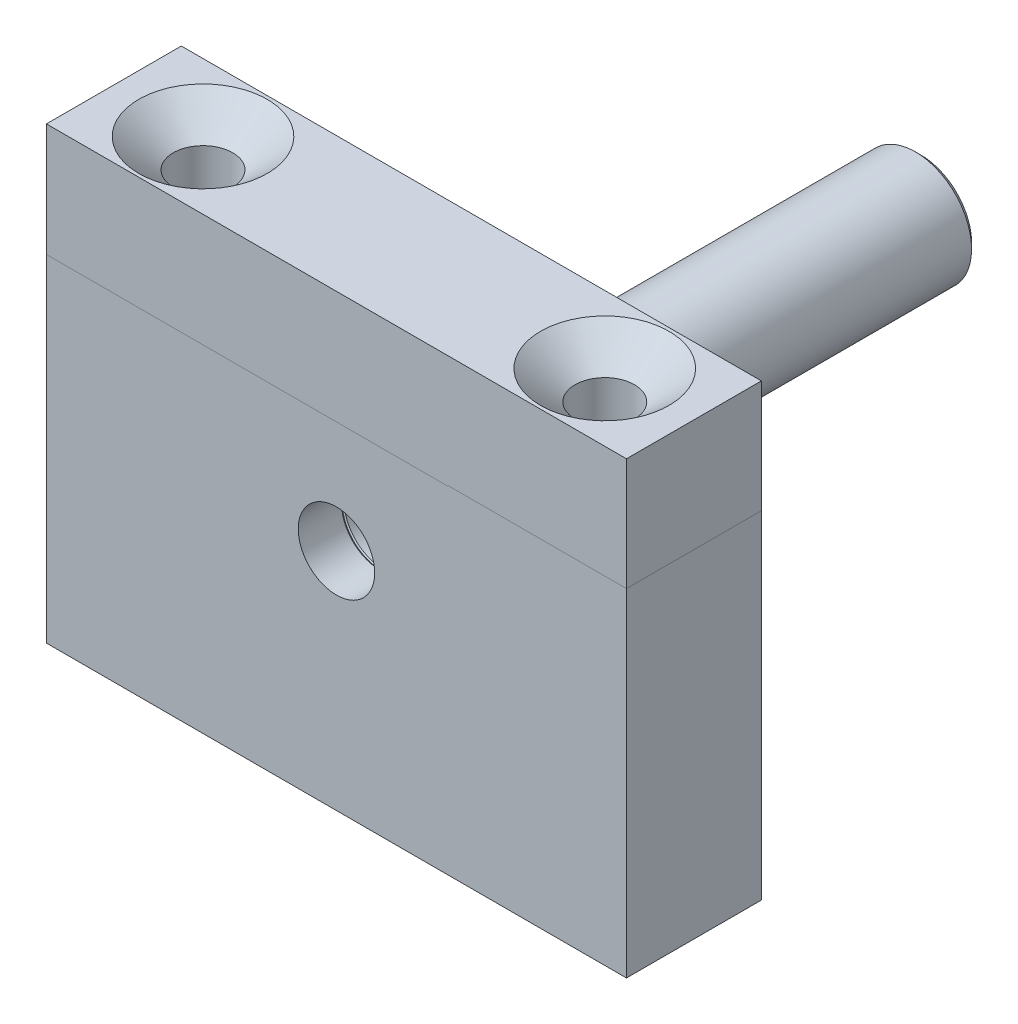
ISO-10303-21;
HEADER;
FILE_DESCRIPTION(('STEP AP214'),'2;1');
FILE_NAME('part.step','',(''),(''),'','','');
FILE_SCHEMA(('AUTOMOTIVE_DESIGN { 1 0 10303 214 1 1 1 1 }'));
ENDSEC;
DATA;
#1=APPLICATION_CONTEXT('core data for automotive mechanical design processes');
#2=APPLICATION_PROTOCOL_DEFINITION('international standard','automotive_design',2000,#1);
#3=PRODUCT_CONTEXT('',#1,'mechanical');
#4=PRODUCT('Part','Part','',(#3));
#5=PRODUCT_RELATED_PRODUCT_CATEGORY('part','',(#4));
#6=PRODUCT_DEFINITION_FORMATION('','',#4);
#7=PRODUCT_DEFINITION_CONTEXT('part definition',#1,'design');
#8=PRODUCT_DEFINITION('design','',#6,#7);
#9=PRODUCT_DEFINITION_SHAPE('','',#8);
#10=(LENGTH_UNIT() NAMED_UNIT(*) SI_UNIT(.MILLI.,.METRE.));
#11=(NAMED_UNIT(*) PLANE_ANGLE_UNIT() SI_UNIT($,.RADIAN.));
#12=(NAMED_UNIT(*) SI_UNIT($,.STERADIAN.) SOLID_ANGLE_UNIT());
#13=UNCERTAINTY_MEASURE_WITH_UNIT(LENGTH_MEASURE(1.E-05),#10,'distance_accuracy_value','');
#14=(GEOMETRIC_REPRESENTATION_CONTEXT(3) GLOBAL_UNCERTAINTY_ASSIGNED_CONTEXT((#13)) GLOBAL_UNIT_ASSIGNED_CONTEXT((#10,
#11,#12)) REPRESENTATION_CONTEXT('',''));
#15=CARTESIAN_POINT('',(0.,0.,0.));
#16=DIRECTION('',(0.,0.,1.));
#17=DIRECTION('',(1.,0.,0.));
#18=AXIS2_PLACEMENT_3D('',#15,#16,#17);
#19=CARTESIAN_POINT('',(-4.97,0.,2.01));
#20=DIRECTION('',(1.,0.,0.));
#21=DIRECTION('',(0.,1.,0.));
#22=AXIS2_PLACEMENT_3D('',#19,#20,#21);
#23=PLANE('',#22);
#24=DIRECTION('',(0.,0.,1.));
#25=VECTOR('',#24,1.);
#26=CARTESIAN_POINT('',(-4.97,4.97,-4.));
#27=LINE('',#26,#25);
#28=CARTESIAN_POINT('',(-4.97,4.97,-4.));
#29=VERTEX_POINT('',#28);
#30=CARTESIAN_POINT('',(-4.97,4.97,0.07));
#31=VERTEX_POINT('',#30);
#32=EDGE_CURVE('E91',#29,#31,#27,.T.);
#33=ORIENTED_EDGE('',*,*,#32,.F.);
#34=DIRECTION('',(0.,-1.,0.));
#35=VECTOR('',#34,1.);
#36=CARTESIAN_POINT('',(-4.97,-10.,-4.));
#37=LINE('',#36,#35);
#38=CARTESIAN_POINT('',(-4.97,0.,-4.));
#39=VERTEX_POINT('',#38);
#40=EDGE_CURVE('E243',#29,#39,#37,.T.);
#41=ORIENTED_EDGE('',*,*,#40,.T.);
#42=DIRECTION('',(0.,0.,-1.));
#43=VECTOR('',#42,1.);
#44=CARTESIAN_POINT('',(-4.97,0.,2.01));
#45=LINE('',#44,#43);
#46=CARTESIAN_POINT('',(-4.97,0.,-2.));
#47=VERTEX_POINT('',#46);
#48=EDGE_CURVE('E234',#47,#39,#45,.T.);
#49=ORIENTED_EDGE('',*,*,#48,.F.);
#50=DIRECTION('',(0.,0.,1.));
#51=VECTOR('',#50,1.);
#52=CARTESIAN_POINT('',(-4.97,0.,0.));
#53=LINE('',#52,#51);
#54=CARTESIAN_POINT('',(-4.97,0.,0.07));
#55=VERTEX_POINT('',#54);
#56=EDGE_CURVE('E244',#55,#47,#53,.F.);
#57=ORIENTED_EDGE('',*,*,#56,.F.);
#58=DIRECTION('',(0.,1.,0.));
#59=VECTOR('',#58,1.);
#60=CARTESIAN_POINT('',(-4.97,0.,0.07));
#61=LINE('',#60,#59);
#62=EDGE_CURVE('E237',#55,#31,#61,.T.);
#63=ORIENTED_EDGE('',*,*,#62,.T.);
#64=EDGE_LOOP('',(#33,#41,#49,#57,#63));
#65=FACE_BOUND('',#64,.T.);
#66=ADVANCED_FACE('F74',(#65),#23,.F.);
#67=CARTESIAN_POINT('',(4.97,0.,2.01));
#68=DIRECTION('',(-1.,0.,0.));
#69=DIRECTION('',(0.,-1.,0.));
#70=AXIS2_PLACEMENT_3D('',#67,#68,#69);
#71=PLANE('',#70);
#72=DIRECTION('',(0.,0.,-1.));
#73=VECTOR('',#72,1.);
#74=CARTESIAN_POINT('',(4.97,5.,2.));
#75=LINE('',#74,#73);
#76=CARTESIAN_POINT('',(4.97,5.,2.));
#77=VERTEX_POINT('',#76);
#78=CARTESIAN_POINT('',(4.97,5.,-4.));
#79=VERTEX_POINT('',#78);
#80=EDGE_CURVE('E204',#77,#79,#75,.T.);
#81=ORIENTED_EDGE('',*,*,#80,.F.);
#82=DIRECTION('',(0.,-1.,0.));
#83=VECTOR('',#82,1.);
#84=CARTESIAN_POINT('',(4.97,-10.,2.));
#85=LINE('',#84,#83);
#86=CARTESIAN_POINT('',(4.97,4.97,2.));
#87=VERTEX_POINT('',#86);
#88=EDGE_CURVE('E221',#77,#87,#85,.T.);
#89=ORIENTED_EDGE('',*,*,#88,.T.);
#90=DIRECTION('',(0.,0.,-1.));
#91=VECTOR('',#90,1.);
#92=CARTESIAN_POINT('',(4.97,4.97,2.01));
#93=LINE('',#92,#91);
#94=CARTESIAN_POINT('',(4.97,4.97,0.07));
#95=VERTEX_POINT('',#94);
#96=EDGE_CURVE('E188',#87,#95,#93,.T.);
#97=ORIENTED_EDGE('',*,*,#96,.T.);
#98=DIRECTION('',(0.,-1.,0.));
#99=VECTOR('',#98,1.);
#100=CARTESIAN_POINT('',(4.97,0.,0.07));
#101=LINE('',#100,#99);
#102=CARTESIAN_POINT('',(4.97,0.,0.07));
#103=VERTEX_POINT('',#102);
#104=EDGE_CURVE('E285',#95,#103,#101,.T.);
#105=ORIENTED_EDGE('',*,*,#104,.T.);
#106=DIRECTION('',(0.,0.,1.));
#107=VECTOR('',#106,1.);
#108=CARTESIAN_POINT('',(4.97,0.,0.));
#109=LINE('',#108,#107);
#110=CARTESIAN_POINT('',(4.97,0.,-2.));
#111=VERTEX_POINT('',#110);
#112=EDGE_CURVE('E276',#103,#111,#109,.F.);
#113=ORIENTED_EDGE('',*,*,#112,.T.);
#114=DIRECTION('',(0.,0.,-1.));
#115=VECTOR('',#114,1.);
#116=CARTESIAN_POINT('',(4.97,0.,2.01));
#117=LINE('',#116,#115);
#118=CARTESIAN_POINT('',(4.97,0.,-4.));
#119=VERTEX_POINT('',#118);
#120=EDGE_CURVE('E263',#111,#119,#117,.T.);
#121=ORIENTED_EDGE('',*,*,#120,.T.);
#122=DIRECTION('',(0.,1.,0.));
#123=VECTOR('',#122,1.);
#124=CARTESIAN_POINT('',(4.97,-10.,-4.));
#125=LINE('',#124,#123);
#126=EDGE_CURVE('E99',#119,#79,#125,.T.);
#127=ORIENTED_EDGE('',*,*,#126,.T.);
#128=EDGE_LOOP('',(#81,#89,#97,#105,#113,#121,#127));
#129=FACE_BOUND('',#128,.T.);
#130=ADVANCED_FACE('F324',(#129),#71,.F.);
#131=CARTESIAN_POINT('',(-4.97,10.01,0.07));
#132=DIRECTION('',(0.,0.,-1.));
#133=DIRECTION('',(-1.,0.,0.));
#134=AXIS2_PLACEMENT_3D('',#131,#132,#133);
#135=PLANE('',#134);
#136=ORIENTED_EDGE('',*,*,#104,.F.);
#137=DIRECTION('',(-1.,0.,0.));
#138=VECTOR('',#137,1.);
#139=CARTESIAN_POINT('',(4.97,4.97,0.0699999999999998));
#140=LINE('',#139,#138);
#141=CARTESIAN_POINT('',(0.,4.97,0.07));
#142=VERTEX_POINT('',#141);
#143=EDGE_CURVE('E83',#95,#142,#140,.T.);
#144=ORIENTED_EDGE('',*,*,#143,.T.);
#145=CARTESIAN_POINT('',(0.,0.,0.07));
#146=DIRECTION('',(0.,0.,-1.));
#147=DIRECTION('',(-1.,0.,0.));
#148=AXIS2_PLACEMENT_3D('',#145,#146,#147);
#149=CIRCLE('',#148,4.97);
#150=EDGE_CURVE('E13',#142,#103,#149,.T.);
#151=ORIENTED_EDGE('',*,*,#150,.T.);
#152=EDGE_LOOP('',(#136,#144,#151));
#153=FACE_BOUND('',#152,.T.);
#154=ADVANCED_FACE('F76',(#153),#135,.F.);
#155=CARTESIAN_POINT('',(0.,4.9,-2.));
#156=DIRECTION('',(0.,0.,1.));
#157=DIRECTION('',(1.,0.,0.));
#158=AXIS2_PLACEMENT_3D('',#155,#156,#157);
#159=PLANE('',#158);
#160=DIRECTION('',(-1.,0.,0.));
#161=VECTOR('',#160,1.);
#162=CARTESIAN_POINT('',(0.,0.,-2.));
#163=LINE('',#162,#161);
#164=CARTESIAN_POINT('',(3.39899494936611,0.,-2.));
#165=VERTEX_POINT('',#164);
#166=EDGE_CURVE('E270',#111,#165,#163,.T.);
#167=ORIENTED_EDGE('',*,*,#166,.F.);
#168=CARTESIAN_POINT('',(0.,0.,-2.));
#169=DIRECTION('',(0.,0.,1.));
#170=DIRECTION('',(1.,0.,0.));
#171=AXIS2_PLACEMENT_3D('',#168,#169,#170);
#172=CIRCLE('',#171,4.97);
#173=EDGE_CURVE('E275',#47,#111,#172,.F.);
#174=ORIENTED_EDGE('',*,*,#173,.F.);
#175=DIRECTION('',(-1.,0.,0.));
#176=VECTOR('',#175,1.);
#177=CARTESIAN_POINT('',(0.,0.,-2.));
#178=LINE('',#177,#176);
#179=CARTESIAN_POINT('',(-3.39899494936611,0.,-2.));
#180=VERTEX_POINT('',#179);
#181=EDGE_CURVE('E238',#180,#47,#178,.T.);
#182=ORIENTED_EDGE('',*,*,#181,.F.);
#183=CARTESIAN_POINT('',(0.,0.,-2.));
#184=DIRECTION('',(0.,0.,1.));
#185=DIRECTION('',(1.,0.,0.));
#186=AXIS2_PLACEMENT_3D('',#183,#184,#185);
#187=CIRCLE('',#186,3.39899494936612);
#188=EDGE_CURVE('E282',#165,#180,#187,.T.);
#189=ORIENTED_EDGE('',*,*,#188,.F.);
#190=EDGE_LOOP('',(#167,#174,#182,#189));
#191=FACE_BOUND('',#190,.T.);
#192=ADVANCED_FACE('F352',(#191),#159,.T.);
#193=CARTESIAN_POINT('',(0.,0.,-2.04949747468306));
#194=DIRECTION('',(0.,0.,1.));
#195=DIRECTION('',(1.,0.,0.));
#196=AXIS2_PLACEMENT_3D('',#193,#194,#195);
#197=CONICAL_SURFACE('',#196,3.34949747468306,0.785398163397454);
#198=ORIENTED_EDGE('',*,*,#188,.T.);
#199=DIRECTION('',(-0.707106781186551,0.,0.707106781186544));
#200=VECTOR('',#199,1.);
#201=CARTESIAN_POINT('',(0.,0.,-5.39899494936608));
#202=LINE('',#201,#200);
#203=CARTESIAN_POINT('',(-2.57,0.,-2.82899494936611));
#204=VERTEX_POINT('',#203);
#205=EDGE_CURVE('E233',#180,#204,#202,.F.);
#206=ORIENTED_EDGE('',*,*,#205,.T.);
#207=CARTESIAN_POINT('',(0.,0.,-2.82899494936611));
#208=DIRECTION('',(0.,0.,1.));
#209=DIRECTION('',(1.,0.,0.));
#210=AXIS2_PLACEMENT_3D('',#207,#208,#209);
#211=CIRCLE('',#210,2.57);
#212=CARTESIAN_POINT('',(2.57,0.,-2.82899494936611));
#213=VERTEX_POINT('',#212);
#214=EDGE_CURVE('E264',#204,#213,#211,.F.);
#215=ORIENTED_EDGE('',*,*,#214,.T.);
#216=DIRECTION('',(-0.707106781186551,0.,-0.707106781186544));
#217=VECTOR('',#216,1.);
#218=CARTESIAN_POINT('',(0.,0.,-5.39899494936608));
#219=LINE('',#218,#217);
#220=EDGE_CURVE('E273',#213,#165,#219,.F.);
#221=ORIENTED_EDGE('',*,*,#220,.T.);
#222=EDGE_LOOP('',(#198,#206,#215,#221));
#223=FACE_BOUND('',#222,.T.);
#224=ADVANCED_FACE('F349',(#223),#197,.F.);
#225=CARTESIAN_POINT('',(-9.9,-10.,-4.));
#226=DIRECTION('',(0.,0.,-1.));
#227=DIRECTION('',(-1.,0.,0.));
#228=AXIS2_PLACEMENT_3D('',#225,#226,#227);
#229=PLANE('',#228);
#230=DIRECTION('',(1.,0.,0.));
#231=VECTOR('',#230,1.);
#232=CARTESIAN_POINT('',(-9.9,0.,-4.));
#233=LINE('',#232,#231);
#234=CARTESIAN_POINT('',(2.57,0.,-4.));
#235=VERTEX_POINT('',#234);
#236=EDGE_CURVE('E279',#235,#119,#233,.T.);
#237=ORIENTED_EDGE('',*,*,#236,.F.);
#238=CARTESIAN_POINT('',(0.,0.,-4.));
#239=DIRECTION('',(0.,0.,-1.));
#240=DIRECTION('',(-1.,0.,0.));
#241=AXIS2_PLACEMENT_3D('',#238,#239,#240);
#242=CIRCLE('',#241,2.57);
#243=CARTESIAN_POINT('',(-2.57,0.,-4.));
#244=VERTEX_POINT('',#243);
#245=EDGE_CURVE('E266',#244,#235,#242,.T.);
#246=ORIENTED_EDGE('',*,*,#245,.F.);
#247=DIRECTION('',(1.,0.,0.));
#248=VECTOR('',#247,1.);
#249=CARTESIAN_POINT('',(-9.9,0.,-4.));
#250=LINE('',#249,#248);
#251=EDGE_CURVE('E241',#39,#244,#250,.T.);
#252=ORIENTED_EDGE('',*,*,#251,.F.);
#253=ORIENTED_EDGE('',*,*,#40,.F.);
#254=DIRECTION('',(1.,0.,0.));
#255=VECTOR('',#254,1.);
#256=CARTESIAN_POINT('',(-20.7294891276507,4.97,-4.));
#257=LINE('',#256,#255);
#258=CARTESIAN_POINT('',(-12.9,4.97,-4.));
#259=VERTEX_POINT('',#258);
#260=EDGE_CURVE('E211',#259,#29,#257,.T.);
#261=ORIENTED_EDGE('',*,*,#260,.F.);
#262=DIRECTION('',(0.,-1.,0.));
#263=VECTOR('',#262,1.);
#264=CARTESIAN_POINT('',(-12.9,10.,-4.));
#265=LINE('',#264,#263);
#266=CARTESIAN_POINT('',(-12.9,10.,-4.));
#267=VERTEX_POINT('',#266);
#268=EDGE_CURVE('E197',#267,#259,#265,.T.);
#269=ORIENTED_EDGE('',*,*,#268,.F.);
#270=DIRECTION('',(-1.,0.,0.));
#271=VECTOR('',#270,1.);
#272=CARTESIAN_POINT('',(-9.9,10.,-4.));
#273=LINE('',#272,#271);
#274=CARTESIAN_POINT('',(12.9,10.,-4.));
#275=VERTEX_POINT('',#274);
#276=EDGE_CURVE('E193',#275,#267,#273,.T.);
#277=ORIENTED_EDGE('',*,*,#276,.F.);
#278=DIRECTION('',(0.,1.,0.));
#279=VECTOR('',#278,1.);
#280=CARTESIAN_POINT('',(12.9,10.,-4.));
#281=LINE('',#280,#279);
#282=CARTESIAN_POINT('',(12.9,5.,-4.));
#283=VERTEX_POINT('',#282);
#284=EDGE_CURVE('E218',#283,#275,#281,.T.);
#285=ORIENTED_EDGE('',*,*,#284,.F.);
#286=DIRECTION('',(-1.,0.,0.));
#287=VECTOR('',#286,1.);
#288=CARTESIAN_POINT('',(20.7102496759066,5.,-4.));
#289=LINE('',#288,#287);
#290=EDGE_CURVE('E217',#283,#79,#289,.T.);
#291=ORIENTED_EDGE('',*,*,#290,.T.);
#292=ORIENTED_EDGE('',*,*,#126,.F.);
#293=EDGE_LOOP('',(#237,#246,#252,#253,#261,#269,#277,#285,#291,#292));
#294=FACE_BOUND('',#293,.T.);
#295=ADVANCED_FACE('F347',(#294),#229,.T.);
#296=CARTESIAN_POINT('',(4.97,0.,2.01));
#297=DIRECTION('',(0.,1.,0.));
#298=DIRECTION('',(0.,0.,1.));
#299=AXIS2_PLACEMENT_3D('',#296,#297,#298);
#300=PLANE('',#299);
#301=ORIENTED_EDGE('',*,*,#236,.T.);
#302=ORIENTED_EDGE('',*,*,#120,.F.);
#303=ORIENTED_EDGE('',*,*,#166,.T.);
#304=ORIENTED_EDGE('',*,*,#220,.F.);
#305=DIRECTION('',(0.,0.,1.));
#306=VECTOR('',#305,1.);
#307=CARTESIAN_POINT('',(2.57,0.,0.));
#308=LINE('',#307,#306);
#309=EDGE_CURVE('E254',#213,#235,#308,.F.);
#310=ORIENTED_EDGE('',*,*,#309,.T.);
#311=EDGE_LOOP('',(#301,#302,#303,#304,#310));
#312=FACE_BOUND('',#311,.T.);
#313=ADVANCED_FACE('F343',(#312),#300,.F.);
#314=CARTESIAN_POINT('',(0.,0.,0.));
#315=DIRECTION('',(0.,0.,1.));
#316=DIRECTION('',(1.,0.,0.));
#317=AXIS2_PLACEMENT_3D('',#314,#315,#316);
#318=CYLINDRICAL_SURFACE('',#317,4.97);
#319=ORIENTED_EDGE('',*,*,#112,.F.);
#320=ORIENTED_EDGE('',*,*,#150,.F.);
#321=CARTESIAN_POINT('',(0.,0.,0.07));
#322=DIRECTION('',(0.,0.,-1.));
#323=DIRECTION('',(-1.,0.,0.));
#324=AXIS2_PLACEMENT_3D('',#321,#322,#323);
#325=CIRCLE('',#324,4.97);
#326=EDGE_CURVE('E260',#55,#142,#325,.T.);
#327=ORIENTED_EDGE('',*,*,#326,.F.);
#328=ORIENTED_EDGE('',*,*,#56,.T.);
#329=ORIENTED_EDGE('',*,*,#173,.T.);
#330=EDGE_LOOP('',(#319,#320,#327,#328,#329));
#331=FACE_BOUND('',#330,.T.);
#332=ADVANCED_FACE('F346',(#331),#318,.F.);
#333=ORIENTED_EDGE('',*,*,#326,.T.);
#334=DIRECTION('',(-1.,0.,0.));
#335=VECTOR('',#334,1.);
#336=CARTESIAN_POINT('',(4.97,4.97,0.0699999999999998));
#337=LINE('',#336,#335);
#338=EDGE_CURVE('E251',#142,#31,#337,.T.);
#339=ORIENTED_EDGE('',*,*,#338,.T.);
#340=ORIENTED_EDGE('',*,*,#62,.F.);
#341=EDGE_LOOP('',(#333,#339,#340));
#342=FACE_BOUND('',#341,.T.);
#343=ADVANCED_FACE('F339',(#342),#135,.F.);
#344=CARTESIAN_POINT('',(0.,0.,0.));
#345=DIRECTION('',(0.,0.,1.));
#346=DIRECTION('',(1.,0.,0.));
#347=AXIS2_PLACEMENT_3D('',#344,#345,#346);
#348=CYLINDRICAL_SURFACE('',#347,2.57);
#349=ORIENTED_EDGE('',*,*,#309,.F.);
#350=ORIENTED_EDGE('',*,*,#214,.F.);
#351=DIRECTION('',(0.,0.,1.));
#352=VECTOR('',#351,1.);
#353=CARTESIAN_POINT('',(-2.57,0.,0.));
#354=LINE('',#353,#352);
#355=EDGE_CURVE('E255',#204,#244,#354,.F.);
#356=ORIENTED_EDGE('',*,*,#355,.T.);
#357=ORIENTED_EDGE('',*,*,#245,.T.);
#358=EDGE_LOOP('',(#349,#350,#356,#357));
#359=FACE_BOUND('',#358,.T.);
#360=ADVANCED_FACE('F336',(#359),#348,.F.);
#361=CARTESIAN_POINT('',(0.,10.,0.));
#362=DIRECTION('',(0.,-1.,0.));
#363=DIRECTION('',(0.,0.,-1.));
#364=AXIS2_PLACEMENT_3D('',#361,#362,#363);
#365=PLANE('',#364);
#366=CARTESIAN_POINT('',(8.935,10.,-1.));
#367=DIRECTION('',(0.,-1.,0.));
#368=DIRECTION('',(0.,0.,1.));
#369=AXIS2_PLACEMENT_3D('',#366,#367,#368);
#370=CIRCLE('',#369,2.8575);
#371=CARTESIAN_POINT('',(8.935,10.,1.8575));
#372=VERTEX_POINT('',#371);
#373=EDGE_CURVE('E306',#372,#372,#370,.T.);
#374=ORIENTED_EDGE('',*,*,#373,.T.);
#375=EDGE_LOOP('',(#374));
#376=FACE_BOUND('',#375,.T.);
#377=CARTESIAN_POINT('',(-8.935,10.,-1.));
#378=DIRECTION('',(0.,1.,0.));
#379=DIRECTION('',(0.,0.,1.));
#380=AXIS2_PLACEMENT_3D('',#377,#378,#379);
#381=CIRCLE('',#380,2.8575);
#382=CARTESIAN_POINT('',(-8.935,10.,1.8575));
#383=VERTEX_POINT('',#382);
#384=EDGE_CURVE('E297',#383,#383,#381,.T.);
#385=ORIENTED_EDGE('',*,*,#384,.F.);
#386=EDGE_LOOP('',(#385));
#387=FACE_BOUND('',#386,.T.);
#388=ORIENTED_EDGE('',*,*,#276,.T.);
#389=DIRECTION('',(0.,0.,-1.));
#390=VECTOR('',#389,1.);
#391=CARTESIAN_POINT('',(-12.9,10.,-4.));
#392=LINE('',#391,#390);
#393=CARTESIAN_POINT('',(-12.9,10.,2.));
#394=VERTEX_POINT('',#393);
#395=EDGE_CURVE('E191',#394,#267,#392,.T.);
#396=ORIENTED_EDGE('',*,*,#395,.F.);
#397=DIRECTION('',(1.,0.,0.));
#398=VECTOR('',#397,1.);
#399=CARTESIAN_POINT('',(-9.9,10.,2.));
#400=LINE('',#399,#398);
#401=CARTESIAN_POINT('',(12.9,10.,2.));
#402=VERTEX_POINT('',#401);
#403=EDGE_CURVE('E174',#394,#402,#400,.T.);
#404=ORIENTED_EDGE('',*,*,#403,.T.);
#405=DIRECTION('',(0.,0.,1.));
#406=VECTOR('',#405,1.);
#407=CARTESIAN_POINT('',(12.9,10.,2.));
#408=LINE('',#407,#406);
#409=EDGE_CURVE('E226',#275,#402,#408,.T.);
#410=ORIENTED_EDGE('',*,*,#409,.F.);
#411=EDGE_LOOP('',(#388,#396,#404,#410));
#412=FACE_BOUND('',#411,.T.);
#413=ADVANCED_FACE('F192',(#376,#387,#412),#365,.F.);
#414=CARTESIAN_POINT('',(4.97,0.,2.01));
#415=DIRECTION('',(0.,1.,0.));
#416=DIRECTION('',(0.,0.,1.));
#417=AXIS2_PLACEMENT_3D('',#414,#415,#416);
#418=PLANE('',#417);
#419=ORIENTED_EDGE('',*,*,#205,.F.);
#420=ORIENTED_EDGE('',*,*,#181,.T.);
#421=ORIENTED_EDGE('',*,*,#48,.T.);
#422=ORIENTED_EDGE('',*,*,#251,.T.);
#423=ORIENTED_EDGE('',*,*,#355,.F.);
#424=EDGE_LOOP('',(#419,#420,#421,#422,#423));
#425=FACE_BOUND('',#424,.T.);
#426=ADVANCED_FACE('F334',(#425),#418,.F.);
#427=CARTESIAN_POINT('',(4.97,4.97,-4.01));
#428=DIRECTION('',(0.,1.,0.));
#429=DIRECTION('',(0.,0.,1.));
#430=AXIS2_PLACEMENT_3D('',#427,#428,#429);
#431=PLANE('',#430);
#432=CARTESIAN_POINT('',(-8.935,4.97,-1.));
#433=DIRECTION('',(0.,1.,0.));
#434=DIRECTION('',(0.,0.,1.));
#435=AXIS2_PLACEMENT_3D('',#432,#433,#434);
#436=CIRCLE('',#435,1.3208);
#437=CARTESIAN_POINT('',(-8.935,4.97,0.320799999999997));
#438=VERTEX_POINT('',#437);
#439=EDGE_CURVE('E214',#438,#438,#436,.T.);
#440=ORIENTED_EDGE('',*,*,#439,.T.);
#441=EDGE_LOOP('',(#440));
#442=FACE_BOUND('',#441,.T.);
#443=ORIENTED_EDGE('',*,*,#143,.F.);
#444=ORIENTED_EDGE('',*,*,#96,.F.);
#445=DIRECTION('',(-1.,0.,0.));
#446=VECTOR('',#445,1.);
#447=CARTESIAN_POINT('',(-9.9,4.97,2.));
#448=LINE('',#447,#446);
#449=CARTESIAN_POINT('',(-12.9,4.97,2.));
#450=VERTEX_POINT('',#449);
#451=EDGE_CURVE('E187',#87,#450,#448,.T.);
#452=ORIENTED_EDGE('',*,*,#451,.T.);
#453=DIRECTION('',(0.,0.,1.));
#454=VECTOR('',#453,1.);
#455=CARTESIAN_POINT('',(-12.9,4.97,-4.));
#456=LINE('',#455,#454);
#457=EDGE_CURVE('E200',#259,#450,#456,.T.);
#458=ORIENTED_EDGE('',*,*,#457,.F.);
#459=ORIENTED_EDGE('',*,*,#260,.T.);
#460=ORIENTED_EDGE('',*,*,#32,.T.);
#461=ORIENTED_EDGE('',*,*,#338,.F.);
#462=EDGE_LOOP('',(#443,#444,#452,#458,#459,#460,#461));
#463=FACE_BOUND('',#462,.T.);
#464=ADVANCED_FACE('F379',(#442,#463),#431,.F.);
#465=CARTESIAN_POINT('',(-9.9,-10.,2.));
#466=DIRECTION('',(0.,0.,1.));
#467=DIRECTION('',(1.,0.,0.));
#468=AXIS2_PLACEMENT_3D('',#465,#466,#467);
#469=PLANE('',#468);
#470=ORIENTED_EDGE('',*,*,#451,.F.);
#471=ORIENTED_EDGE('',*,*,#88,.F.);
#472=DIRECTION('',(-1.,0.,0.));
#473=VECTOR('',#472,1.);
#474=CARTESIAN_POINT('',(20.7102496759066,5.,2.));
#475=LINE('',#474,#473);
#476=CARTESIAN_POINT('',(12.9,5.,2.));
#477=VERTEX_POINT('',#476);
#478=EDGE_CURVE('E201',#477,#77,#475,.T.);
#479=ORIENTED_EDGE('',*,*,#478,.F.);
#480=DIRECTION('',(0.,-1.,0.));
#481=VECTOR('',#480,1.);
#482=CARTESIAN_POINT('',(12.9,10.,2.));
#483=LINE('',#482,#481);
#484=EDGE_CURVE('E183',#402,#477,#483,.T.);
#485=ORIENTED_EDGE('',*,*,#484,.F.);
#486=ORIENTED_EDGE('',*,*,#403,.F.);
#487=DIRECTION('',(0.,1.,0.));
#488=VECTOR('',#487,1.);
#489=CARTESIAN_POINT('',(-12.9,10.,2.));
#490=LINE('',#489,#488);
#491=EDGE_CURVE('E179',#450,#394,#490,.T.);
#492=ORIENTED_EDGE('',*,*,#491,.F.);
#493=EDGE_LOOP('',(#470,#471,#479,#485,#486,#492));
#494=FACE_BOUND('',#493,.T.);
#495=ADVANCED_FACE('F177',(#494),#469,.T.);
#496=CARTESIAN_POINT('',(20.7102496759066,5.,2.));
#497=DIRECTION('',(0.,1.,0.));
#498=DIRECTION('',(-1.,0.,0.));
#499=AXIS2_PLACEMENT_3D('',#496,#497,#498);
#500=PLANE('',#499);
#501=CARTESIAN_POINT('',(8.935,5.,-1.));
#502=DIRECTION('',(0.,1.,0.));
#503=DIRECTION('',(-1.,0.,0.));
#504=AXIS2_PLACEMENT_3D('',#501,#502,#503);
#505=CIRCLE('',#504,1.3208);
#506=CARTESIAN_POINT('',(7.6142,5.,-1.));
#507=VERTEX_POINT('',#506);
#508=EDGE_CURVE('E78',#507,#507,#505,.T.);
#509=ORIENTED_EDGE('',*,*,#508,.T.);
#510=EDGE_LOOP('',(#509));
#511=FACE_BOUND('',#510,.T.);
#512=DIRECTION('',(0.,0.,-1.));
#513=VECTOR('',#512,1.);
#514=CARTESIAN_POINT('',(12.9,5.,2.));
#515=LINE('',#514,#513);
#516=EDGE_CURVE('E222',#477,#283,#515,.T.);
#517=ORIENTED_EDGE('',*,*,#516,.F.);
#518=ORIENTED_EDGE('',*,*,#478,.T.);
#519=ORIENTED_EDGE('',*,*,#80,.T.);
#520=ORIENTED_EDGE('',*,*,#290,.F.);
#521=EDGE_LOOP('',(#517,#518,#519,#520));
#522=FACE_BOUND('',#521,.T.);
#523=ADVANCED_FACE('F384',(#511,#522),#500,.F.);
#524=CARTESIAN_POINT('',(12.9,-10.,2.));
#525=DIRECTION('',(1.,0.,0.));
#526=DIRECTION('',(0.,0.,-1.));
#527=AXIS2_PLACEMENT_3D('',#524,#525,#526);
#528=PLANE('',#527);
#529=ORIENTED_EDGE('',*,*,#409,.T.);
#530=ORIENTED_EDGE('',*,*,#484,.T.);
#531=ORIENTED_EDGE('',*,*,#516,.T.);
#532=ORIENTED_EDGE('',*,*,#284,.T.);
#533=EDGE_LOOP('',(#529,#530,#531,#532));
#534=FACE_BOUND('',#533,.T.);
#535=ADVANCED_FACE('F386',(#534),#528,.T.);
#536=CARTESIAN_POINT('',(-12.9,-10.,2.));
#537=DIRECTION('',(-1.,0.,0.));
#538=DIRECTION('',(0.,0.,1.));
#539=AXIS2_PLACEMENT_3D('',#536,#537,#538);
#540=PLANE('',#539);
#541=ORIENTED_EDGE('',*,*,#395,.T.);
#542=ORIENTED_EDGE('',*,*,#268,.T.);
#543=ORIENTED_EDGE('',*,*,#457,.T.);
#544=ORIENTED_EDGE('',*,*,#491,.T.);
#545=EDGE_LOOP('',(#541,#542,#543,#544));
#546=FACE_BOUND('',#545,.T.);
#547=ADVANCED_FACE('F199',(#546),#540,.T.);
#548=CARTESIAN_POINT('',(-8.935,10.,-1.));
#549=DIRECTION('',(0.,1.,0.));
#550=DIRECTION('',(0.,0.,1.));
#551=AXIS2_PLACEMENT_3D('',#548,#549,#550);
#552=CYLINDRICAL_SURFACE('',#551,1.3208);
#553=CARTESIAN_POINT('',(-8.935,8.71055559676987,-1.));
#554=DIRECTION('',(0.,1.,0.));
#555=DIRECTION('',(0.,0.,1.));
#556=AXIS2_PLACEMENT_3D('',#553,#554,#555);
#557=CIRCLE('',#556,1.3208);
#558=CARTESIAN_POINT('',(-8.935,8.71055559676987,0.320799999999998));
#559=VERTEX_POINT('',#558);
#560=EDGE_CURVE('E293',#559,#559,#557,.T.);
#561=ORIENTED_EDGE('',*,*,#560,.T.);
#562=EDGE_LOOP('',(#561));
#563=FACE_BOUND('',#562,.T.);
#564=ORIENTED_EDGE('',*,*,#439,.F.);
#565=EDGE_LOOP('',(#564));
#566=FACE_BOUND('',#565,.T.);
#567=ADVANCED_FACE('F391',(#563,#566),#552,.F.);
#568=CARTESIAN_POINT('',(-8.935,10.,-1.));
#569=DIRECTION('',(0.,1.,0.));
#570=DIRECTION('',(0.,0.,1.));
#571=AXIS2_PLACEMENT_3D('',#568,#569,#570);
#572=CONICAL_SURFACE('',#571,2.8575,0.872664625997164);
#573=ORIENTED_EDGE('',*,*,#560,.F.);
#574=EDGE_LOOP('',(#573));
#575=FACE_BOUND('',#574,.T.);
#576=ORIENTED_EDGE('',*,*,#384,.T.);
#577=EDGE_LOOP('',(#576));
#578=FACE_BOUND('',#577,.T.);
#579=ADVANCED_FACE('F320',(#575,#578),#572,.F.);
#580=CARTESIAN_POINT('',(8.935,10.,-1.));
#581=DIRECTION('',(0.,1.,0.));
#582=DIRECTION('',(0.,0.,1.));
#583=AXIS2_PLACEMENT_3D('',#580,#581,#582);
#584=CYLINDRICAL_SURFACE('',#583,1.3208);
#585=CARTESIAN_POINT('',(8.935,8.71055559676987,-1.));
#586=DIRECTION('',(0.,-1.,0.));
#587=DIRECTION('',(0.,0.,1.));
#588=AXIS2_PLACEMENT_3D('',#585,#586,#587);
#589=CIRCLE('',#588,1.3208);
#590=CARTESIAN_POINT('',(8.935,8.71055559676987,0.320799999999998));
#591=VERTEX_POINT('',#590);
#592=EDGE_CURVE('E303',#591,#591,#589,.T.);
#593=ORIENTED_EDGE('',*,*,#592,.F.);
#594=EDGE_LOOP('',(#593));
#595=FACE_BOUND('',#594,.T.);
#596=ORIENTED_EDGE('',*,*,#508,.F.);
#597=EDGE_LOOP('',(#596));
#598=FACE_BOUND('',#597,.T.);
#599=ADVANCED_FACE('F314',(#595,#598),#584,.F.);
#600=CARTESIAN_POINT('',(8.935,10.,-1.));
#601=DIRECTION('',(0.,1.,0.));
#602=DIRECTION('',(0.,0.,1.));
#603=AXIS2_PLACEMENT_3D('',#600,#601,#602);
#604=CONICAL_SURFACE('',#603,2.8575,0.872664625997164);
#605=ORIENTED_EDGE('',*,*,#592,.T.);
#606=EDGE_LOOP('',(#605));
#607=FACE_BOUND('',#606,.T.);
#608=ORIENTED_EDGE('',*,*,#373,.F.);
#609=EDGE_LOOP('',(#608));
#610=FACE_BOUND('',#609,.T.);
#611=ADVANCED_FACE('F312',(#607,#610),#604,.F.);
#612=CLOSED_SHELL('',(#66,#130,#154,#192,#224,#295,#313,#332,#343,#360,#413,#426,#464,#495,#523,
#535,#547,#567,#579,#599,#611));
#613=MANIFOLD_SOLID_BREP('B2',#612);
#614=CARTESIAN_POINT('',(-4.97,0.,2.01));
#615=DIRECTION('',(1.,0.,0.));
#616=DIRECTION('',(0.,1.,0.));
#617=AXIS2_PLACEMENT_3D('',#614,#615,#616);
#618=PLANE('',#617);
#619=DIRECTION('',(0.,1.,0.));
#620=VECTOR('',#619,1.);
#621=CARTESIAN_POINT('',(-4.97,0.,0.07));
#622=LINE('',#621,#620);
#623=CARTESIAN_POINT('',(-4.97,0.,0.07));
#624=VERTEX_POINT('',#623);
#625=CARTESIAN_POINT('',(-4.97,4.97,0.07));
#626=VERTEX_POINT('',#625);
#627=EDGE_CURVE('E792',#624,#626,#622,.T.);
#628=ORIENTED_EDGE('',*,*,#627,.F.);
#629=DIRECTION('',(0.,0.,1.));
#630=VECTOR('',#629,1.);
#631=CARTESIAN_POINT('',(-4.97,0.,0.));
#632=LINE('',#631,#630);
#633=CARTESIAN_POINT('',(-4.97,0.,-2.));
#634=VERTEX_POINT('',#633);
#635=EDGE_CURVE('E757',#624,#634,#632,.F.);
#636=ORIENTED_EDGE('',*,*,#635,.T.);
#637=DIRECTION('',(0.,0.,-1.));
#638=VECTOR('',#637,1.);
#639=CARTESIAN_POINT('',(-4.97,0.,2.01));
#640=LINE('',#639,#638);
#641=CARTESIAN_POINT('',(-4.97,0.,-4.));
#642=VERTEX_POINT('',#641);
#643=EDGE_CURVE('E731',#634,#642,#640,.T.);
#644=ORIENTED_EDGE('',*,*,#643,.T.);
#645=DIRECTION('',(0.,-1.,0.));
#646=VECTOR('',#645,1.);
#647=CARTESIAN_POINT('',(-4.97,-10.,-4.));
#648=LINE('',#647,#646);
#649=CARTESIAN_POINT('',(-4.97,5.,-4.));
#650=VERTEX_POINT('',#649);
#651=EDGE_CURVE('E756',#650,#642,#648,.T.);
#652=ORIENTED_EDGE('',*,*,#651,.F.);
#653=DIRECTION('',(0.,0.,1.));
#654=VECTOR('',#653,1.);
#655=CARTESIAN_POINT('',(-4.97,5.,0.));
#656=LINE('',#655,#654);
#657=CARTESIAN_POINT('',(-4.97,5.,2.));
#658=VERTEX_POINT('',#657);
#659=EDGE_CURVE('E762',#650,#658,#656,.T.);
#660=ORIENTED_EDGE('',*,*,#659,.T.);
#661=DIRECTION('',(0.,1.,0.));
#662=VECTOR('',#661,1.);
#663=CARTESIAN_POINT('',(-4.97,-10.,2.));
#664=LINE('',#663,#662);
#665=CARTESIAN_POINT('',(-4.97,4.97,2.));
#666=VERTEX_POINT('',#665);
#667=EDGE_CURVE('E627',#666,#658,#664,.T.);
#668=ORIENTED_EDGE('',*,*,#667,.F.);
#669=DIRECTION('',(0.,0.,1.));
#670=VECTOR('',#669,1.);
#671=CARTESIAN_POINT('',(-4.97,4.97,2.01));
#672=LINE('',#671,#670);
#673=EDGE_CURVE('E72',#626,#666,#672,.T.);
#674=ORIENTED_EDGE('',*,*,#673,.F.);
#675=EDGE_LOOP('',(#628,#636,#644,#652,#660,#668,#674));
#676=FACE_BOUND('',#675,.T.);
#677=ADVANCED_FACE('F608',(#676),#618,.T.);
#678=CARTESIAN_POINT('',(4.97,0.,2.01));
#679=DIRECTION('',(-1.,0.,0.));
#680=DIRECTION('',(0.,-1.,0.));
#681=AXIS2_PLACEMENT_3D('',#678,#679,#680);
#682=PLANE('',#681);
#683=DIRECTION('',(0.,-1.,0.));
#684=VECTOR('',#683,1.);
#685=CARTESIAN_POINT('',(4.97,0.,0.07));
#686=LINE('',#685,#684);
#687=CARTESIAN_POINT('',(4.97,4.97,0.07));
#688=VERTEX_POINT('',#687);
#689=CARTESIAN_POINT('',(4.97,0.,0.07));
#690=VERTEX_POINT('',#689);
#691=EDGE_CURVE('E741',#688,#690,#686,.T.);
#692=ORIENTED_EDGE('',*,*,#691,.F.);
#693=DIRECTION('',(0.,0.,-1.));
#694=VECTOR('',#693,1.);
#695=CARTESIAN_POINT('',(4.97,4.97,2.01));
#696=LINE('',#695,#694);
#697=CARTESIAN_POINT('',(4.97,4.97,2.));
#698=VERTEX_POINT('',#697);
#699=EDGE_CURVE('E789',#698,#688,#696,.T.);
#700=ORIENTED_EDGE('',*,*,#699,.F.);
#701=DIRECTION('',(0.,-1.,0.));
#702=VECTOR('',#701,1.);
#703=CARTESIAN_POINT('',(4.97,-10.,2.));
#704=LINE('',#703,#702);
#705=CARTESIAN_POINT('',(4.97,5.,2.));
#706=VERTEX_POINT('',#705);
#707=EDGE_CURVE('E746',#706,#698,#704,.T.);
#708=ORIENTED_EDGE('',*,*,#707,.F.);
#709=DIRECTION('',(0.,0.,-1.));
#710=VECTOR('',#709,1.);
#711=CARTESIAN_POINT('',(4.97,5.,0.));
#712=LINE('',#711,#710);
#713=CARTESIAN_POINT('',(4.97,5.,-4.));
#714=VERTEX_POINT('',#713);
#715=EDGE_CURVE('E677',#706,#714,#712,.T.);
#716=ORIENTED_EDGE('',*,*,#715,.T.);
#717=DIRECTION('',(0.,1.,0.));
#718=VECTOR('',#717,1.);
#719=CARTESIAN_POINT('',(4.97,-10.,-4.));
#720=LINE('',#719,#718);
#721=CARTESIAN_POINT('',(4.97,0.,-4.));
#722=VERTEX_POINT('',#721);
#723=EDGE_CURVE('E748',#722,#714,#720,.T.);
#724=ORIENTED_EDGE('',*,*,#723,.F.);
#725=DIRECTION('',(0.,0.,-1.));
#726=VECTOR('',#725,1.);
#727=CARTESIAN_POINT('',(4.97,0.,2.01));
#728=LINE('',#727,#726);
#729=CARTESIAN_POINT('',(4.97,0.,-2.));
#730=VERTEX_POINT('',#729);
#731=EDGE_CURVE('E738',#730,#722,#728,.T.);
#732=ORIENTED_EDGE('',*,*,#731,.F.);
#733=DIRECTION('',(0.,0.,1.));
#734=VECTOR('',#733,1.);
#735=CARTESIAN_POINT('',(4.97,0.,0.));
#736=LINE('',#735,#734);
#737=EDGE_CURVE('E753',#690,#730,#736,.F.);
#738=ORIENTED_EDGE('',*,*,#737,.F.);
#739=EDGE_LOOP('',(#692,#700,#708,#716,#724,#732,#738));
#740=FACE_BOUND('',#739,.T.);
#741=ADVANCED_FACE('F811',(#740),#682,.T.);
#742=CARTESIAN_POINT('',(4.97,0.,2.01));
#743=DIRECTION('',(0.,1.,0.));
#744=DIRECTION('',(0.,0.,1.));
#745=AXIS2_PLACEMENT_3D('',#742,#743,#744);
#746=PLANE('',#745);
#747=DIRECTION('',(-0.707106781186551,0.,0.707106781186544));
#748=VECTOR('',#747,1.);
#749=CARTESIAN_POINT('',(0.,0.,-5.39899494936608));
#750=LINE('',#749,#748);
#751=CARTESIAN_POINT('',(-3.39899494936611,0.,-2.));
#752=VERTEX_POINT('',#751);
#753=CARTESIAN_POINT('',(-2.57,0.,-2.82899494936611));
#754=VERTEX_POINT('',#753);
#755=EDGE_CURVE('E761',#752,#754,#750,.F.);
#756=ORIENTED_EDGE('',*,*,#755,.T.);
#757=DIRECTION('',(0.,0.,1.));
#758=VECTOR('',#757,1.);
#759=CARTESIAN_POINT('',(-2.57,0.,0.));
#760=LINE('',#759,#758);
#761=CARTESIAN_POINT('',(-2.57,0.,-4.));
#762=VERTEX_POINT('',#761);
#763=EDGE_CURVE('E707',#754,#762,#760,.F.);
#764=ORIENTED_EDGE('',*,*,#763,.T.);
#765=DIRECTION('',(1.,0.,0.));
#766=VECTOR('',#765,1.);
#767=CARTESIAN_POINT('',(-9.9,0.,-4.));
#768=LINE('',#767,#766);
#769=EDGE_CURVE('E778',#642,#762,#768,.T.);
#770=ORIENTED_EDGE('',*,*,#769,.F.);
#771=ORIENTED_EDGE('',*,*,#643,.F.);
#772=DIRECTION('',(-1.,0.,0.));
#773=VECTOR('',#772,1.);
#774=CARTESIAN_POINT('',(0.,0.,-2.));
#775=LINE('',#774,#773);
#776=EDGE_CURVE('E783',#752,#634,#775,.T.);
#777=ORIENTED_EDGE('',*,*,#776,.F.);
#778=EDGE_LOOP('',(#756,#764,#770,#771,#777));
#779=FACE_BOUND('',#778,.T.);
#780=ADVANCED_FACE('F878',(#779),#746,.T.);
#781=CARTESIAN_POINT('',(2.57,0.,-4.));
#782=VERTEX_POINT('',#781);
#783=EDGE_CURVE('E752',#782,#722,#768,.T.);
#784=ORIENTED_EDGE('',*,*,#783,.F.);
#785=DIRECTION('',(0.,0.,1.));
#786=VECTOR('',#785,1.);
#787=CARTESIAN_POINT('',(2.57,0.,0.));
#788=LINE('',#787,#786);
#789=CARTESIAN_POINT('',(2.57,0.,-2.82899494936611));
#790=VERTEX_POINT('',#789);
#791=EDGE_CURVE('E742',#790,#782,#788,.F.);
#792=ORIENTED_EDGE('',*,*,#791,.F.);
#793=DIRECTION('',(-0.707106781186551,0.,-0.707106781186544));
#794=VECTOR('',#793,1.);
#795=CARTESIAN_POINT('',(0.,0.,-5.39899494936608));
#796=LINE('',#795,#794);
#797=CARTESIAN_POINT('',(3.39899494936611,0.,-2.));
#798=VERTEX_POINT('',#797);
#799=EDGE_CURVE('E758',#790,#798,#796,.F.);
#800=ORIENTED_EDGE('',*,*,#799,.T.);
#801=EDGE_CURVE('E751',#730,#798,#775,.T.);
#802=ORIENTED_EDGE('',*,*,#801,.F.);
#803=ORIENTED_EDGE('',*,*,#731,.T.);
#804=EDGE_LOOP('',(#784,#792,#800,#802,#803));
#805=FACE_BOUND('',#804,.T.);
#806=ADVANCED_FACE('F883',(#805),#746,.T.);
#807=CARTESIAN_POINT('',(0.,-10.,0.));
#808=DIRECTION('',(0.,-1.,0.));
#809=DIRECTION('',(0.,0.,-1.));
#810=AXIS2_PLACEMENT_3D('',#807,#808,#809);
#811=PLANE('',#810);
#812=DIRECTION('',(0.,0.,1.));
#813=VECTOR('',#812,1.);
#814=CARTESIAN_POINT('',(-12.9,-10.,2.));
#815=LINE('',#814,#813);
#816=CARTESIAN_POINT('',(-12.9,-10.,-4.));
#817=VERTEX_POINT('',#816);
#818=CARTESIAN_POINT('',(-12.9,-10.,2.));
#819=VERTEX_POINT('',#818);
#820=EDGE_CURVE('E737',#817,#819,#815,.T.);
#821=ORIENTED_EDGE('',*,*,#820,.F.);
#822=DIRECTION('',(-1.,0.,0.));
#823=VECTOR('',#822,1.);
#824=CARTESIAN_POINT('',(-9.9,-10.,-4.));
#825=LINE('',#824,#823);
#826=CARTESIAN_POINT('',(12.9,-10.,-4.));
#827=VERTEX_POINT('',#826);
#828=EDGE_CURVE('E732',#827,#817,#825,.T.);
#829=ORIENTED_EDGE('',*,*,#828,.F.);
#830=DIRECTION('',(0.,0.,-1.));
#831=VECTOR('',#830,1.);
#832=CARTESIAN_POINT('',(12.9,-10.,2.));
#833=LINE('',#832,#831);
#834=CARTESIAN_POINT('',(12.9,-10.,2.));
#835=VERTEX_POINT('',#834);
#836=EDGE_CURVE('E735',#835,#827,#833,.T.);
#837=ORIENTED_EDGE('',*,*,#836,.F.);
#838=DIRECTION('',(1.,0.,0.));
#839=VECTOR('',#838,1.);
#840=CARTESIAN_POINT('',(-9.9,-10.,2.));
#841=LINE('',#840,#839);
#842=EDGE_CURVE('E689',#819,#835,#841,.T.);
#843=ORIENTED_EDGE('',*,*,#842,.F.);
#844=EDGE_LOOP('',(#821,#829,#837,#843));
#845=FACE_BOUND('',#844,.T.);
#846=ADVANCED_FACE('F880',(#845),#811,.T.);
#847=CARTESIAN_POINT('',(-12.9,-10.,2.));
#848=DIRECTION('',(-1.,0.,0.));
#849=DIRECTION('',(0.,0.,1.));
#850=AXIS2_PLACEMENT_3D('',#847,#848,#849);
#851=PLANE('',#850);
#852=DIRECTION('',(0.,1.,0.));
#853=VECTOR('',#852,1.);
#854=CARTESIAN_POINT('',(-12.9,-10.,2.));
#855=LINE('',#854,#853);
#856=CARTESIAN_POINT('',(-12.9,5.,2.));
#857=VERTEX_POINT('',#856);
#858=EDGE_CURVE('E693',#819,#857,#855,.T.);
#859=ORIENTED_EDGE('',*,*,#858,.T.);
#860=DIRECTION('',(0.,0.,1.));
#861=VECTOR('',#860,1.);
#862=CARTESIAN_POINT('',(-12.9,5.,2.));
#863=LINE('',#862,#861);
#864=CARTESIAN_POINT('',(-12.9,5.,-4.));
#865=VERTEX_POINT('',#864);
#866=EDGE_CURVE('E681',#865,#857,#863,.T.);
#867=ORIENTED_EDGE('',*,*,#866,.F.);
#868=DIRECTION('',(0.,1.,0.));
#869=VECTOR('',#868,1.);
#870=CARTESIAN_POINT('',(-12.9,-10.,-4.));
#871=LINE('',#870,#869);
#872=EDGE_CURVE('E769',#817,#865,#871,.T.);
#873=ORIENTED_EDGE('',*,*,#872,.F.);
#874=ORIENTED_EDGE('',*,*,#820,.T.);
#875=EDGE_LOOP('',(#859,#867,#873,#874));
#876=FACE_BOUND('',#875,.T.);
#877=ADVANCED_FACE('F887',(#876),#851,.T.);
#878=CARTESIAN_POINT('',(-9.9,-10.,-4.));
#879=DIRECTION('',(0.,0.,-1.));
#880=DIRECTION('',(-1.,0.,0.));
#881=AXIS2_PLACEMENT_3D('',#878,#879,#880);
#882=PLANE('',#881);
#883=DIRECTION('',(-1.,0.,0.));
#884=VECTOR('',#883,1.);
#885=CARTESIAN_POINT('',(-9.9,5.,-4.));
#886=LINE('',#885,#884);
#887=EDGE_CURVE('E697',#650,#865,#886,.T.);
#888=ORIENTED_EDGE('',*,*,#887,.F.);
#889=ORIENTED_EDGE('',*,*,#651,.T.);
#890=ORIENTED_EDGE('',*,*,#769,.T.);
#891=CARTESIAN_POINT('',(0.,0.,-4.));
#892=DIRECTION('',(0.,0.,-1.));
#893=DIRECTION('',(-1.,0.,0.));
#894=AXIS2_PLACEMENT_3D('',#891,#892,#893);
#895=CIRCLE('',#894,2.57);
#896=EDGE_CURVE('E723',#782,#762,#895,.T.);
#897=ORIENTED_EDGE('',*,*,#896,.F.);
#898=ORIENTED_EDGE('',*,*,#783,.T.);
#899=ORIENTED_EDGE('',*,*,#723,.T.);
#900=DIRECTION('',(-1.,0.,0.));
#901=VECTOR('',#900,1.);
#902=CARTESIAN_POINT('',(-9.9,5.,-4.));
#903=LINE('',#902,#901);
#904=CARTESIAN_POINT('',(12.9,5.,-4.));
#905=VERTEX_POINT('',#904);
#906=EDGE_CURVE('E701',#905,#714,#903,.T.);
#907=ORIENTED_EDGE('',*,*,#906,.F.);
#908=DIRECTION('',(0.,1.,0.));
#909=VECTOR('',#908,1.);
#910=CARTESIAN_POINT('',(12.9,-10.,-4.));
#911=LINE('',#910,#909);
#912=EDGE_CURVE('E694',#827,#905,#911,.T.);
#913=ORIENTED_EDGE('',*,*,#912,.F.);
#914=ORIENTED_EDGE('',*,*,#828,.T.);
#915=ORIENTED_EDGE('',*,*,#872,.T.);
#916=EDGE_LOOP('',(#888,#889,#890,#897,#898,#899,#907,#913,#914,#915));
#917=FACE_BOUND('',#916,.T.);
#918=ADVANCED_FACE('F884',(#917),#882,.T.);
#919=CARTESIAN_POINT('',(12.9,-10.,2.));
#920=DIRECTION('',(1.,0.,0.));
#921=DIRECTION('',(0.,0.,-1.));
#922=AXIS2_PLACEMENT_3D('',#919,#920,#921);
#923=PLANE('',#922);
#924=ORIENTED_EDGE('',*,*,#912,.T.);
#925=DIRECTION('',(0.,0.,-1.));
#926=VECTOR('',#925,1.);
#927=CARTESIAN_POINT('',(12.9,5.,2.));
#928=LINE('',#927,#926);
#929=CARTESIAN_POINT('',(12.9,5.,2.));
#930=VERTEX_POINT('',#929);
#931=EDGE_CURVE('E674',#930,#905,#928,.T.);
#932=ORIENTED_EDGE('',*,*,#931,.F.);
#933=DIRECTION('',(0.,1.,0.));
#934=VECTOR('',#933,1.);
#935=CARTESIAN_POINT('',(12.9,-10.,2.));
#936=LINE('',#935,#934);
#937=EDGE_CURVE('E685',#835,#930,#936,.T.);
#938=ORIENTED_EDGE('',*,*,#937,.F.);
#939=ORIENTED_EDGE('',*,*,#836,.T.);
#940=EDGE_LOOP('',(#924,#932,#938,#939));
#941=FACE_BOUND('',#940,.T.);
#942=ADVANCED_FACE('F696',(#941),#923,.T.);
#943=CARTESIAN_POINT('',(0.,5.,0.));
#944=DIRECTION('',(0.,-1.,0.));
#945=DIRECTION('',(0.,0.,-1.));
#946=AXIS2_PLACEMENT_3D('',#943,#944,#945);
#947=PLANE('',#946);
#948=CARTESIAN_POINT('',(8.935,5.,-1.));
#949=DIRECTION('',(0.,1.,0.));
#950=DIRECTION('',(0.,0.,-1.));
#951=AXIS2_PLACEMENT_3D('',#948,#949,#950);
#952=CIRCLE('',#951,1.3208);
#953=CARTESIAN_POINT('',(8.935,5.,-2.3208));
#954=VERTEX_POINT('',#953);
#955=EDGE_CURVE('E719',#954,#954,#952,.T.);
#956=ORIENTED_EDGE('',*,*,#955,.F.);
#957=EDGE_LOOP('',(#956));
#958=FACE_BOUND('',#957,.T.);
#959=ORIENTED_EDGE('',*,*,#715,.F.);
#960=DIRECTION('',(1.,0.,0.));
#961=VECTOR('',#960,1.);
#962=CARTESIAN_POINT('',(-9.9,5.,2.));
#963=LINE('',#962,#961);
#964=EDGE_CURVE('E670',#706,#930,#963,.T.);
#965=ORIENTED_EDGE('',*,*,#964,.T.);
#966=ORIENTED_EDGE('',*,*,#931,.T.);
#967=ORIENTED_EDGE('',*,*,#906,.T.);
#968=EDGE_LOOP('',(#959,#965,#966,#967));
#969=FACE_BOUND('',#968,.T.);
#970=ADVANCED_FACE('F672',(#958,#969),#947,.F.);
#971=CARTESIAN_POINT('',(-8.935,5.,-1.));
#972=DIRECTION('',(0.,-1.,0.));
#973=DIRECTION('',(0.,0.,-1.));
#974=AXIS2_PLACEMENT_3D('',#971,#972,#973);
#975=CIRCLE('',#974,1.3208);
#976=CARTESIAN_POINT('',(-8.935,5.,-2.3208));
#977=VERTEX_POINT('',#976);
#978=EDGE_CURVE('E705',#977,#977,#975,.T.);
#979=ORIENTED_EDGE('',*,*,#978,.T.);
#980=EDGE_LOOP('',(#979));
#981=FACE_BOUND('',#980,.T.);
#982=ORIENTED_EDGE('',*,*,#659,.F.);
#983=ORIENTED_EDGE('',*,*,#887,.T.);
#984=ORIENTED_EDGE('',*,*,#866,.T.);
#985=DIRECTION('',(1.,0.,0.));
#986=VECTOR('',#985,1.);
#987=CARTESIAN_POINT('',(-9.9,5.,2.));
#988=LINE('',#987,#986);
#989=EDGE_CURVE('E682',#857,#658,#988,.T.);
#990=ORIENTED_EDGE('',*,*,#989,.T.);
#991=EDGE_LOOP('',(#982,#983,#984,#990));
#992=FACE_BOUND('',#991,.T.);
#993=ADVANCED_FACE('F610',(#981,#992),#947,.F.);
#994=CARTESIAN_POINT('',(0.,0.,0.));
#995=DIRECTION('',(0.,0.,1.));
#996=DIRECTION('',(1.,0.,0.));
#997=AXIS2_PLACEMENT_3D('',#994,#995,#996);
#998=CYLINDRICAL_SURFACE('',#997,4.97);
#999=ORIENTED_EDGE('',*,*,#635,.F.);
#1000=CARTESIAN_POINT('',(0.,0.,0.07));
#1001=DIRECTION('',(0.,0.,-1.));
#1002=DIRECTION('',(-1.,0.,0.));
#1003=AXIS2_PLACEMENT_3D('',#1000,#1001,#1002);
#1004=CIRCLE('',#1003,4.97);
#1005=EDGE_CURVE('E766',#690,#624,#1004,.T.);
#1006=ORIENTED_EDGE('',*,*,#1005,.F.);
#1007=ORIENTED_EDGE('',*,*,#737,.T.);
#1008=CARTESIAN_POINT('',(0.,0.,-2.));
#1009=DIRECTION('',(0.,0.,1.));
#1010=DIRECTION('',(1.,0.,0.));
#1011=AXIS2_PLACEMENT_3D('',#1008,#1009,#1010);
#1012=CIRCLE('',#1011,4.97);
#1013=EDGE_CURVE('E745',#730,#634,#1012,.F.);
#1014=ORIENTED_EDGE('',*,*,#1013,.T.);
#1015=EDGE_LOOP('',(#999,#1006,#1007,#1014));
#1016=FACE_BOUND('',#1015,.T.);
#1017=ADVANCED_FACE('F895',(#1016),#998,.F.);
#1018=CARTESIAN_POINT('',(0.,0.,0.));
#1019=DIRECTION('',(0.,0.,1.));
#1020=DIRECTION('',(1.,0.,0.));
#1021=AXIS2_PLACEMENT_3D('',#1018,#1019,#1020);
#1022=CYLINDRICAL_SURFACE('',#1021,2.57);
#1023=CARTESIAN_POINT('',(0.,0.,-2.82899494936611));
#1024=DIRECTION('',(0.,0.,1.));
#1025=DIRECTION('',(1.,0.,0.));
#1026=AXIS2_PLACEMENT_3D('',#1023,#1024,#1025);
#1027=CIRCLE('',#1026,2.57);
#1028=EDGE_CURVE('E727',#790,#754,#1027,.F.);
#1029=ORIENTED_EDGE('',*,*,#1028,.F.);
#1030=ORIENTED_EDGE('',*,*,#791,.T.);
#1031=ORIENTED_EDGE('',*,*,#896,.T.);
#1032=ORIENTED_EDGE('',*,*,#763,.F.);
#1033=EDGE_LOOP('',(#1029,#1030,#1031,#1032));
#1034=FACE_BOUND('',#1033,.T.);
#1035=ADVANCED_FACE('F898',(#1034),#1022,.F.);
#1036=CARTESIAN_POINT('',(0.,4.9,-2.));
#1037=DIRECTION('',(0.,0.,1.));
#1038=DIRECTION('',(1.,0.,0.));
#1039=AXIS2_PLACEMENT_3D('',#1036,#1037,#1038);
#1040=PLANE('',#1039);
#1041=ORIENTED_EDGE('',*,*,#1013,.F.);
#1042=ORIENTED_EDGE('',*,*,#801,.T.);
#1043=CARTESIAN_POINT('',(0.,0.,-2.));
#1044=DIRECTION('',(0.,0.,1.));
#1045=DIRECTION('',(1.,0.,0.));
#1046=AXIS2_PLACEMENT_3D('',#1043,#1044,#1045);
#1047=CIRCLE('',#1046,3.39899494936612);
#1048=EDGE_CURVE('E726',#752,#798,#1047,.T.);
#1049=ORIENTED_EDGE('',*,*,#1048,.F.);
#1050=ORIENTED_EDGE('',*,*,#776,.T.);
#1051=EDGE_LOOP('',(#1041,#1042,#1049,#1050));
#1052=FACE_BOUND('',#1051,.T.);
#1053=ADVANCED_FACE('F893',(#1052),#1040,.T.);
#1054=CARTESIAN_POINT('',(0.,0.,-2.04949747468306));
#1055=DIRECTION('',(0.,0.,1.));
#1056=DIRECTION('',(1.,0.,0.));
#1057=AXIS2_PLACEMENT_3D('',#1054,#1055,#1056);
#1058=CONICAL_SURFACE('',#1057,3.34949747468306,0.785398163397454);
#1059=ORIENTED_EDGE('',*,*,#755,.F.);
#1060=ORIENTED_EDGE('',*,*,#1048,.T.);
#1061=ORIENTED_EDGE('',*,*,#799,.F.);
#1062=ORIENTED_EDGE('',*,*,#1028,.T.);
#1063=EDGE_LOOP('',(#1059,#1060,#1061,#1062));
#1064=FACE_BOUND('',#1063,.T.);
#1065=ADVANCED_FACE('F889',(#1064),#1058,.F.);
#1066=CARTESIAN_POINT('',(-4.97,10.01,0.07));
#1067=DIRECTION('',(0.,0.,-1.));
#1068=DIRECTION('',(-1.,0.,0.));
#1069=AXIS2_PLACEMENT_3D('',#1066,#1067,#1068);
#1070=PLANE('',#1069);
#1071=CARTESIAN_POINT('',(0.,0.,0.0700000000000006));
#1072=DIRECTION('',(0.,0.,-1.));
#1073=DIRECTION('',(-1.,0.,0.));
#1074=AXIS2_PLACEMENT_3D('',#1071,#1072,#1073);
#1075=CIRCLE('',#1074,1.7);
#1076=CARTESIAN_POINT('',(-1.7,0.,0.0700000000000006));
#1077=VERTEX_POINT('',#1076);
#1078=EDGE_CURVE('E922',#1077,#1077,#1075,.T.);
#1079=ORIENTED_EDGE('',*,*,#1078,.F.);
#1080=EDGE_LOOP('',(#1079));
#1081=FACE_BOUND('',#1080,.T.);
#1082=DIRECTION('',(-1.,0.,0.));
#1083=VECTOR('',#1082,1.);
#1084=CARTESIAN_POINT('',(4.97,4.97,0.0699999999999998));
#1085=LINE('',#1084,#1083);
#1086=EDGE_CURVE('E794',#688,#626,#1085,.T.);
#1087=ORIENTED_EDGE('',*,*,#1086,.F.);
#1088=ORIENTED_EDGE('',*,*,#691,.T.);
#1089=ORIENTED_EDGE('',*,*,#1005,.T.);
#1090=ORIENTED_EDGE('',*,*,#627,.T.);
#1091=EDGE_LOOP('',(#1087,#1088,#1089,#1090));
#1092=FACE_BOUND('',#1091,.T.);
#1093=ADVANCED_FACE('F892',(#1081,#1092),#1070,.T.);
#1094=CARTESIAN_POINT('',(4.97,4.97,-4.01));
#1095=DIRECTION('',(0.,1.,0.));
#1096=DIRECTION('',(0.,0.,1.));
#1097=AXIS2_PLACEMENT_3D('',#1094,#1095,#1096);
#1098=PLANE('',#1097);
#1099=DIRECTION('',(-1.,0.,0.));
#1100=VECTOR('',#1099,1.);
#1101=CARTESIAN_POINT('',(-9.9,4.97,2.));
#1102=LINE('',#1101,#1100);
#1103=EDGE_CURVE('E618',#698,#666,#1102,.T.);
#1104=ORIENTED_EDGE('',*,*,#1103,.F.);
#1105=ORIENTED_EDGE('',*,*,#699,.T.);
#1106=ORIENTED_EDGE('',*,*,#1086,.T.);
#1107=ORIENTED_EDGE('',*,*,#673,.T.);
#1108=EDGE_LOOP('',(#1104,#1105,#1106,#1107));
#1109=FACE_BOUND('',#1108,.T.);
#1110=ADVANCED_FACE('F905',(#1109),#1098,.T.);
#1111=CARTESIAN_POINT('',(-9.9,-10.,2.));
#1112=DIRECTION('',(0.,0.,1.));
#1113=DIRECTION('',(1.,0.,0.));
#1114=AXIS2_PLACEMENT_3D('',#1111,#1112,#1113);
#1115=PLANE('',#1114);
#1116=CARTESIAN_POINT('',(0.,0.,2.));
#1117=DIRECTION('',(0.,0.,1.));
#1118=DIRECTION('',(1.,0.,0.));
#1119=AXIS2_PLACEMENT_3D('',#1116,#1117,#1118);
#1120=CIRCLE('',#1119,1.7);
#1121=CARTESIAN_POINT('',(1.7,0.,2.));
#1122=VERTEX_POINT('',#1121);
#1123=EDGE_CURVE('E612',#1122,#1122,#1120,.T.);
#1124=ORIENTED_EDGE('',*,*,#1123,.F.);
#1125=EDGE_LOOP('',(#1124));
#1126=FACE_BOUND('',#1125,.T.);
#1127=ORIENTED_EDGE('',*,*,#1103,.T.);
#1128=ORIENTED_EDGE('',*,*,#667,.T.);
#1129=ORIENTED_EDGE('',*,*,#989,.F.);
#1130=ORIENTED_EDGE('',*,*,#858,.F.);
#1131=ORIENTED_EDGE('',*,*,#842,.T.);
#1132=ORIENTED_EDGE('',*,*,#937,.T.);
#1133=ORIENTED_EDGE('',*,*,#964,.F.);
#1134=ORIENTED_EDGE('',*,*,#707,.T.);
#1135=EDGE_LOOP('',(#1127,#1128,#1129,#1130,#1131,#1132,#1133,#1134));
#1136=FACE_BOUND('',#1135,.T.);
#1137=ADVANCED_FACE('F687',(#1126,#1136),#1115,.T.);
#1138=CARTESIAN_POINT('',(-8.935,10.,-1.));
#1139=DIRECTION('',(0.,1.,0.));
#1140=DIRECTION('',(0.,0.,1.));
#1141=AXIS2_PLACEMENT_3D('',#1138,#1139,#1140);
#1142=CYLINDRICAL_SURFACE('',#1141,1.3208);
#1143=CARTESIAN_POINT('',(-8.935,-3.,-1.));
#1144=DIRECTION('',(0.,1.,0.));
#1145=DIRECTION('',(0.,0.,1.));
#1146=AXIS2_PLACEMENT_3D('',#1143,#1144,#1145);
#1147=CIRCLE('',#1146,1.3208);
#1148=CARTESIAN_POINT('',(-8.935,-3.,0.320799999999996));
#1149=VERTEX_POINT('',#1148);
#1150=EDGE_CURVE('E708',#1149,#1149,#1147,.T.);
#1151=ORIENTED_EDGE('',*,*,#1150,.F.);
#1152=EDGE_LOOP('',(#1151));
#1153=FACE_BOUND('',#1152,.T.);
#1154=ORIENTED_EDGE('',*,*,#978,.F.);
#1155=EDGE_LOOP('',(#1154));
#1156=FACE_BOUND('',#1155,.T.);
#1157=ADVANCED_FACE('F867',(#1153,#1156),#1142,.F.);
#1158=CARTESIAN_POINT('',(-8.935,-3.,-1.));
#1159=DIRECTION('',(0.,1.,0.));
#1160=DIRECTION('',(0.,0.,1.));
#1161=AXIS2_PLACEMENT_3D('',#1158,#1159,#1160);
#1162=CONICAL_SURFACE('',#1161,1.3208,1.02974425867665);
#1163=CARTESIAN_POINT('',(-8.935,-3.7936167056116,-1.));
#1164=VERTEX_POINT('',#1163);
#1165=VERTEX_LOOP('',#1164);
#1166=FACE_BOUND('',#1165,.T.);
#1167=ORIENTED_EDGE('',*,*,#1150,.T.);
#1168=EDGE_LOOP('',(#1167));
#1169=FACE_BOUND('',#1168,.T.);
#1170=ADVANCED_FACE('F860',(#1166,#1169),#1162,.F.);
#1171=CARTESIAN_POINT('',(8.935,10.,-1.));
#1172=DIRECTION('',(0.,1.,0.));
#1173=DIRECTION('',(0.,0.,1.));
#1174=AXIS2_PLACEMENT_3D('',#1171,#1172,#1173);
#1175=CYLINDRICAL_SURFACE('',#1174,1.3208);
#1176=ORIENTED_EDGE('',*,*,#955,.T.);
#1177=EDGE_LOOP('',(#1176));
#1178=FACE_BOUND('',#1177,.T.);
#1179=CARTESIAN_POINT('',(8.935,-3.,-1.));
#1180=DIRECTION('',(0.,-1.,0.));
#1181=DIRECTION('',(0.,0.,1.));
#1182=AXIS2_PLACEMENT_3D('',#1179,#1180,#1181);
#1183=CIRCLE('',#1182,1.3208);
#1184=CARTESIAN_POINT('',(8.935,-3.,0.320799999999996));
#1185=VERTEX_POINT('',#1184);
#1186=EDGE_CURVE('E714',#1185,#1185,#1183,.T.);
#1187=ORIENTED_EDGE('',*,*,#1186,.T.);
#1188=EDGE_LOOP('',(#1187));
#1189=FACE_BOUND('',#1188,.T.);
#1190=ADVANCED_FACE('F855',(#1178,#1189),#1175,.F.);
#1191=CARTESIAN_POINT('',(8.935,-3.,-1.));
#1192=DIRECTION('',(0.,1.,0.));
#1193=DIRECTION('',(0.,0.,1.));
#1194=AXIS2_PLACEMENT_3D('',#1191,#1192,#1193);
#1195=CONICAL_SURFACE('',#1194,1.3208,1.02974425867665);
#1196=CARTESIAN_POINT('',(8.935,-3.7936167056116,-1.));
#1197=VERTEX_POINT('',#1196);
#1198=VERTEX_LOOP('',#1197);
#1199=FACE_BOUND('',#1198,.T.);
#1200=ORIENTED_EDGE('',*,*,#1186,.F.);
#1201=EDGE_LOOP('',(#1200));
#1202=FACE_BOUND('',#1201,.T.);
#1203=ADVANCED_FACE('F851',(#1199,#1202),#1195,.F.);
#1204=CARTESIAN_POINT('',(0.,0.,-24.));
#1205=DIRECTION('',(0.,0.,1.));
#1206=DIRECTION('',(1.,0.,0.));
#1207=AXIS2_PLACEMENT_3D('',#1204,#1205,#1206);
#1208=CYLINDRICAL_SURFACE('',#1207,1.7);
#1209=ORIENTED_EDGE('',*,*,#1078,.T.);
#1210=EDGE_LOOP('',(#1209));
#1211=FACE_BOUND('',#1210,.T.);
#1212=ORIENTED_EDGE('',*,*,#1123,.T.);
#1213=EDGE_LOOP('',(#1212));
#1214=FACE_BOUND('',#1213,.T.);
#1215=ADVANCED_FACE('F854',(#1211,#1214),#1208,.F.);
#1216=CLOSED_SHELL('',(#677,#741,#780,#806,#846,#877,#918,#942,#970,#993,#1017,#1035,#1053,
#1065,#1093,#1110,#1137,#1157,#1170,#1190,#1203,#1215));
#1217=MANIFOLD_SOLID_BREP('B7',#1216);
#1218=CARTESIAN_POINT('',(0.,4.9,-2.));
#1219=DIRECTION('',(0.,0.,1.));
#1220=DIRECTION('',(1.,0.,0.));
#1221=AXIS2_PLACEMENT_3D('',#1218,#1219,#1220);
#1222=PLANE('',#1221);
#1223=CARTESIAN_POINT('',(0.,0.,-2.));
#1224=DIRECTION('',(0.,0.,1.));
#1225=DIRECTION('',(1.,0.,0.));
#1226=AXIS2_PLACEMENT_3D('',#1223,#1224,#1225);
#1227=CIRCLE('',#1226,3.3);
#1228=CARTESIAN_POINT('',(3.3,0.,-2.));
#1229=VERTEX_POINT('',#1228);
#1230=EDGE_CURVE('E1172',#1229,#1229,#1227,.T.);
#1231=ORIENTED_EDGE('',*,*,#1230,.T.);
#1232=EDGE_LOOP('',(#1231));
#1233=FACE_BOUND('',#1232,.T.);
#1234=CARTESIAN_POINT('',(0.,0.,-2.));
#1235=DIRECTION('',(0.,0.,-1.));
#1236=DIRECTION('',(1.,0.,0.));
#1237=AXIS2_PLACEMENT_3D('',#1234,#1235,#1236);
#1238=CIRCLE('',#1237,4.65);
#1239=CARTESIAN_POINT('',(4.65,0.,-2.));
#1240=VERTEX_POINT('',#1239);
#1241=EDGE_CURVE('E1195',#1240,#1240,#1238,.T.);
#1242=ORIENTED_EDGE('',*,*,#1241,.T.);
#1243=EDGE_LOOP('',(#1242));
#1244=FACE_BOUND('',#1243,.T.);
#1245=ADVANCED_FACE('F1146',(#1233,#1244),#1222,.F.);
#1246=CARTESIAN_POINT('',(0.,1.25,0.));
#1247=DIRECTION('',(0.,0.,-1.));
#1248=DIRECTION('',(0.,-1.,0.));
#1249=AXIS2_PLACEMENT_3D('',#1246,#1247,#1248);
#1250=PLANE('',#1249);
#1251=CARTESIAN_POINT('',(0.,0.,0.));
#1252=DIRECTION('',(0.,0.,-1.));
#1253=DIRECTION('',(-1.,0.,0.));
#1254=AXIS2_PLACEMENT_3D('',#1251,#1252,#1253);
#1255=CIRCLE('',#1254,1.75);
#1256=CARTESIAN_POINT('',(-1.75,0.,0.));
#1257=VERTEX_POINT('',#1256);
#1258=EDGE_CURVE('E607',#1257,#1257,#1255,.T.);
#1259=ORIENTED_EDGE('',*,*,#1258,.T.);
#1260=EDGE_LOOP('',(#1259));
#1261=FACE_BOUND('',#1260,.T.);
#1262=CARTESIAN_POINT('',(0.,0.,0.));
#1263=DIRECTION('',(0.,0.,1.));
#1264=DIRECTION('',(-1.,0.,0.));
#1265=AXIS2_PLACEMENT_3D('',#1262,#1263,#1264);
#1266=CIRCLE('',#1265,4.65);
#1267=CARTESIAN_POINT('',(-4.65,0.,0.));
#1268=VERTEX_POINT('',#1267);
#1269=EDGE_CURVE('E1190',#1268,#1268,#1266,.T.);
#1270=ORIENTED_EDGE('',*,*,#1269,.T.);
#1271=EDGE_LOOP('',(#1270));
#1272=FACE_BOUND('',#1271,.T.);
#1273=ADVANCED_FACE('F1214',(#1261,#1272),#1250,.F.);
#1274=CARTESIAN_POINT('',(0.,2.5,-24.));
#1275=DIRECTION('',(0.,0.,1.));
#1276=DIRECTION('',(1.,0.,0.));
#1277=AXIS2_PLACEMENT_3D('',#1274,#1275,#1276);
#1278=PLANE('',#1277);
#1279=CARTESIAN_POINT('',(0.,0.,-24.));
#1280=DIRECTION('',(0.,0.,1.));
#1281=DIRECTION('',(1.,0.,0.));
#1282=AXIS2_PLACEMENT_3D('',#1279,#1280,#1281);
#1283=CIRCLE('',#1282,1.75);
#1284=CARTESIAN_POINT('',(1.75,0.,-24.));
#1285=VERTEX_POINT('',#1284);
#1286=EDGE_CURVE('E1155',#1285,#1285,#1283,.T.);
#1287=ORIENTED_EDGE('',*,*,#1286,.T.);
#1288=EDGE_LOOP('',(#1287));
#1289=FACE_BOUND('',#1288,.T.);
#1290=CARTESIAN_POINT('',(0.,0.,-24.));
#1291=DIRECTION('',(0.,0.,-1.));
#1292=DIRECTION('',(1.,0.,0.));
#1293=AXIS2_PLACEMENT_3D('',#1290,#1291,#1292);
#1294=CIRCLE('',#1293,2.25);
#1295=CARTESIAN_POINT('',(2.25,0.,-24.));
#1296=VERTEX_POINT('',#1295);
#1297=EDGE_CURVE('E1169',#1296,#1296,#1294,.T.);
#1298=ORIENTED_EDGE('',*,*,#1297,.T.);
#1299=EDGE_LOOP('',(#1298));
#1300=FACE_BOUND('',#1299,.T.);
#1301=ADVANCED_FACE('F1216',(#1289,#1300),#1278,.F.);
#1302=CARTESIAN_POINT('',(0.,0.,-0.5));
#1303=DIRECTION('',(0.,0.,1.));
#1304=DIRECTION('',(1.,0.,0.));
#1305=AXIS2_PLACEMENT_3D('',#1302,#1303,#1304);
#1306=CONICAL_SURFACE('',#1305,1.25,0.78539816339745);
#1307=CARTESIAN_POINT('',(0.,0.,-0.050000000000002));
#1308=DIRECTION('',(0.,0.,1.));
#1309=DIRECTION('',(1.,0.,0.));
#1310=AXIS2_PLACEMENT_3D('',#1307,#1308,#1309);
#1311=CIRCLE('',#1310,1.7);
#1312=CARTESIAN_POINT('',(1.7,0.,-0.050000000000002));
#1313=VERTEX_POINT('',#1312);
#1314=EDGE_CURVE('E1175',#1313,#1313,#1311,.F.);
#1315=ORIENTED_EDGE('',*,*,#1314,.T.);
#1316=EDGE_LOOP('',(#1315));
#1317=FACE_BOUND('',#1316,.T.);
#1318=ORIENTED_EDGE('',*,*,#1258,.F.);
#1319=EDGE_LOOP('',(#1318));
#1320=FACE_BOUND('',#1319,.T.);
#1321=ADVANCED_FACE('F1223',(#1317,#1320),#1306,.F.);
#1322=CARTESIAN_POINT('',(0.,0.,-24.));
#1323=DIRECTION('',(0.,0.,-1.));
#1324=DIRECTION('',(-1.,0.,0.));
#1325=AXIS2_PLACEMENT_3D('',#1322,#1323,#1324);
#1326=CONICAL_SURFACE('',#1325,1.75,0.785398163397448);
#1327=CARTESIAN_POINT('',(0.,0.,-23.95));
#1328=DIRECTION('',(0.,0.,-1.));
#1329=DIRECTION('',(-1.,0.,0.));
#1330=AXIS2_PLACEMENT_3D('',#1327,#1328,#1329);
#1331=CIRCLE('',#1330,1.7);
#1332=CARTESIAN_POINT('',(-1.7,0.,-23.95));
#1333=VERTEX_POINT('',#1332);
#1334=EDGE_CURVE('E1173',#1333,#1333,#1331,.F.);
#1335=ORIENTED_EDGE('',*,*,#1334,.T.);
#1336=EDGE_LOOP('',(#1335));
#1337=FACE_BOUND('',#1336,.T.);
#1338=ORIENTED_EDGE('',*,*,#1286,.F.);
#1339=EDGE_LOOP('',(#1338));
#1340=FACE_BOUND('',#1339,.T.);
#1341=ADVANCED_FACE('F1229',(#1337,#1340),#1326,.F.);
#1342=CARTESIAN_POINT('',(0.,0.,0.));
#1343=DIRECTION('',(0.,0.,1.));
#1344=DIRECTION('',(1.,0.,0.));
#1345=AXIS2_PLACEMENT_3D('',#1342,#1343,#1344);
#1346=CYLINDRICAL_SURFACE('',#1345,4.9);
#1347=CARTESIAN_POINT('',(0.,0.,-0.25));
#1348=DIRECTION('',(0.,0.,-1.));
#1349=DIRECTION('',(-1.,0.,0.));
#1350=AXIS2_PLACEMENT_3D('',#1347,#1348,#1349);
#1351=CIRCLE('',#1350,4.9);
#1352=CARTESIAN_POINT('',(-4.9,0.,-0.25));
#1353=VERTEX_POINT('',#1352);
#1354=EDGE_CURVE('E1194',#1353,#1353,#1351,.T.);
#1355=ORIENTED_EDGE('',*,*,#1354,.T.);
#1356=EDGE_LOOP('',(#1355));
#1357=FACE_BOUND('',#1356,.T.);
#1358=CARTESIAN_POINT('',(0.,0.,-1.75));
#1359=DIRECTION('',(0.,0.,1.));
#1360=DIRECTION('',(1.,0.,0.));
#1361=AXIS2_PLACEMENT_3D('',#1358,#1359,#1360);
#1362=CIRCLE('',#1361,4.9);
#1363=CARTESIAN_POINT('',(4.9,0.,-1.75));
#1364=VERTEX_POINT('',#1363);
#1365=EDGE_CURVE('E1164',#1364,#1364,#1362,.T.);
#1366=ORIENTED_EDGE('',*,*,#1365,.T.);
#1367=EDGE_LOOP('',(#1366));
#1368=FACE_BOUND('',#1367,.T.);
#1369=ADVANCED_FACE('F1204',(#1357,#1368),#1346,.T.);
#1370=CARTESIAN_POINT('',(0.,0.,0.));
#1371=DIRECTION('',(0.,0.,1.));
#1372=DIRECTION('',(1.,0.,0.));
#1373=AXIS2_PLACEMENT_3D('',#1370,#1371,#1372);
#1374=CYLINDRICAL_SURFACE('',#1373,2.5);
#1375=CARTESIAN_POINT('',(0.,0.,-2.8));
#1376=DIRECTION('',(0.,0.,-1.));
#1377=DIRECTION('',(1.,0.,0.));
#1378=AXIS2_PLACEMENT_3D('',#1375,#1376,#1377);
#1379=CIRCLE('',#1378,2.5);
#1380=CARTESIAN_POINT('',(2.5,0.,-2.8));
#1381=VERTEX_POINT('',#1380);
#1382=EDGE_CURVE('E1179',#1381,#1381,#1379,.T.);
#1383=ORIENTED_EDGE('',*,*,#1382,.T.);
#1384=EDGE_LOOP('',(#1383));
#1385=FACE_BOUND('',#1384,.T.);
#1386=CARTESIAN_POINT('',(0.,0.,-23.75));
#1387=DIRECTION('',(0.,0.,1.));
#1388=DIRECTION('',(1.,0.,0.));
#1389=AXIS2_PLACEMENT_3D('',#1386,#1387,#1388);
#1390=CIRCLE('',#1389,2.5);
#1391=CARTESIAN_POINT('',(2.5,0.,-23.75));
#1392=VERTEX_POINT('',#1391);
#1393=EDGE_CURVE('E1150',#1392,#1392,#1390,.T.);
#1394=ORIENTED_EDGE('',*,*,#1393,.T.);
#1395=EDGE_LOOP('',(#1394));
#1396=FACE_BOUND('',#1395,.T.);
#1397=ADVANCED_FACE('F1236',(#1385,#1396),#1374,.T.);
#1398=CARTESIAN_POINT('',(0.,0.,-1.75));
#1399=DIRECTION('',(0.,0.,1.));
#1400=DIRECTION('',(1.,0.,0.));
#1401=AXIS2_PLACEMENT_3D('',#1398,#1399,#1400);
#1402=CONICAL_SURFACE('',#1401,4.9,0.78539816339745);
#1403=ORIENTED_EDGE('',*,*,#1365,.F.);
#1404=EDGE_LOOP('',(#1403));
#1405=FACE_BOUND('',#1404,.T.);
#1406=ORIENTED_EDGE('',*,*,#1241,.F.);
#1407=EDGE_LOOP('',(#1406));
#1408=FACE_BOUND('',#1407,.T.);
#1409=ADVANCED_FACE('F1210',(#1405,#1408),#1402,.T.);
#1410=CARTESIAN_POINT('',(0.,0.,0.));
#1411=DIRECTION('',(0.,0.,-1.));
#1412=DIRECTION('',(-1.,0.,0.));
#1413=AXIS2_PLACEMENT_3D('',#1410,#1411,#1412);
#1414=CONICAL_SURFACE('',#1413,4.65,0.785398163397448);
#1415=ORIENTED_EDGE('',*,*,#1354,.F.);
#1416=EDGE_LOOP('',(#1415));
#1417=FACE_BOUND('',#1416,.T.);
#1418=ORIENTED_EDGE('',*,*,#1269,.F.);
#1419=EDGE_LOOP('',(#1418));
#1420=FACE_BOUND('',#1419,.T.);
#1421=ADVANCED_FACE('F1207',(#1417,#1420),#1414,.T.);
#1422=CARTESIAN_POINT('',(0.,0.,-23.75));
#1423=DIRECTION('',(0.,0.,1.));
#1424=DIRECTION('',(1.,0.,0.));
#1425=AXIS2_PLACEMENT_3D('',#1422,#1423,#1424);
#1426=CONICAL_SURFACE('',#1425,2.5,0.785398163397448);
#1427=ORIENTED_EDGE('',*,*,#1393,.F.);
#1428=EDGE_LOOP('',(#1427));
#1429=FACE_BOUND('',#1428,.T.);
#1430=ORIENTED_EDGE('',*,*,#1297,.F.);
#1431=EDGE_LOOP('',(#1430));
#1432=FACE_BOUND('',#1431,.T.);
#1433=ADVANCED_FACE('F1148',(#1429,#1432),#1426,.T.);
#1434=CARTESIAN_POINT('',(0.,0.,-2.));
#1435=DIRECTION('',(0.,0.,1.));
#1436=DIRECTION('',(1.,0.,0.));
#1437=AXIS2_PLACEMENT_3D('',#1434,#1435,#1436);
#1438=CONICAL_SURFACE('',#1437,3.3,0.785398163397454);
#1439=ORIENTED_EDGE('',*,*,#1230,.F.);
#1440=EDGE_LOOP('',(#1439));
#1441=FACE_BOUND('',#1440,.T.);
#1442=ORIENTED_EDGE('',*,*,#1382,.F.);
#1443=EDGE_LOOP('',(#1442));
#1444=FACE_BOUND('',#1443,.T.);
#1445=ADVANCED_FACE('F1244',(#1441,#1444),#1438,.T.);
#1446=CARTESIAN_POINT('',(0.,0.,0.));
#1447=DIRECTION('',(0.,0.,-1.));
#1448=DIRECTION('',(-1.,0.,0.));
#1449=AXIS2_PLACEMENT_3D('',#1446,#1447,#1448);
#1450=CYLINDRICAL_SURFACE('',#1449,1.7);
#1451=ORIENTED_EDGE('',*,*,#1334,.F.);
#1452=EDGE_LOOP('',(#1451));
#1453=FACE_BOUND('',#1452,.T.);
#1454=ORIENTED_EDGE('',*,*,#1314,.F.);
#1455=EDGE_LOOP('',(#1454));
#1456=FACE_BOUND('',#1455,.T.);
#1457=ADVANCED_FACE('F1250',(#1453,#1456),#1450,.F.);
#1458=CLOSED_SHELL('',(#1245,#1273,#1301,#1321,#1341,#1369,#1397,#1409,#1421,#1433,#1445,#1457));
#1459=MANIFOLD_SOLID_BREP('B66_NOT_SHOWN',#1458);
#1460=ADVANCED_BREP_SHAPE_REPRESENTATION('',(#18,#613,#1217,#1459),#14);
#1461=SHAPE_DEFINITION_REPRESENTATION(#9,#1460);
ENDSEC;
END-ISO-10303-21;
